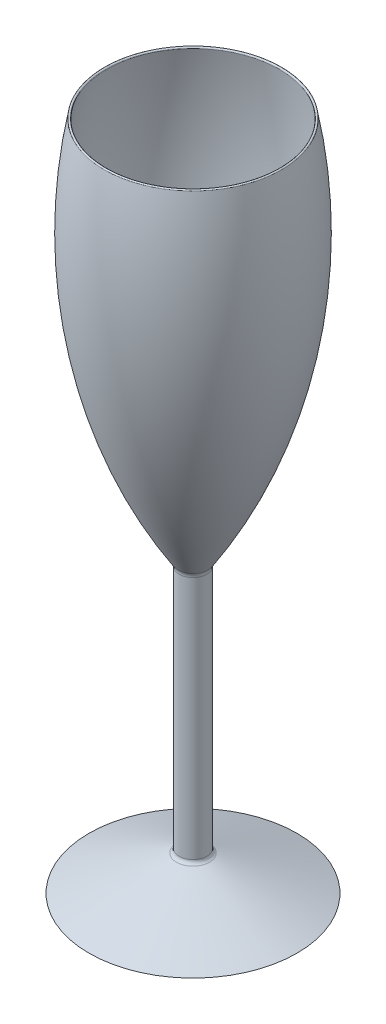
ISO-10303-21;
HEADER;
FILE_DESCRIPTION(('STEP AP214'),'2;1');
FILE_NAME('part.step','',(''),(''),'','','');
FILE_SCHEMA(('AUTOMOTIVE_DESIGN { 1 0 10303 214 1 1 1 1 }'));
ENDSEC;
DATA;
#1=APPLICATION_CONTEXT('core data for automotive mechanical design processes');
#2=APPLICATION_PROTOCOL_DEFINITION('international standard','automotive_design',2000,#1);
#3=PRODUCT_CONTEXT('',#1,'mechanical');
#4=PRODUCT('Part','Part','',(#3));
#5=PRODUCT_RELATED_PRODUCT_CATEGORY('part','',(#4));
#6=PRODUCT_DEFINITION_FORMATION('','',#4);
#7=PRODUCT_DEFINITION_CONTEXT('part definition',#1,'design');
#8=PRODUCT_DEFINITION('design','',#6,#7);
#9=PRODUCT_DEFINITION_SHAPE('','',#8);
#10=(LENGTH_UNIT() NAMED_UNIT(*) SI_UNIT(.MILLI.,.METRE.));
#11=(NAMED_UNIT(*) PLANE_ANGLE_UNIT() SI_UNIT($,.RADIAN.));
#12=(NAMED_UNIT(*) SI_UNIT($,.STERADIAN.) SOLID_ANGLE_UNIT());
#13=UNCERTAINTY_MEASURE_WITH_UNIT(LENGTH_MEASURE(1.E-05),#10,'distance_accuracy_value','');
#14=(GEOMETRIC_REPRESENTATION_CONTEXT(3) GLOBAL_UNCERTAINTY_ASSIGNED_CONTEXT((#13)) GLOBAL_UNIT_ASSIGNED_CONTEXT((#10,
#11,#12)) REPRESENTATION_CONTEXT('',''));
#15=CARTESIAN_POINT('',(0.,0.,0.));
#16=DIRECTION('',(0.,0.,1.));
#17=DIRECTION('',(1.,0.,0.));
#18=AXIS2_PLACEMENT_3D('',#15,#16,#17);
#19=CARTESIAN_POINT('',(0.,204.75125415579,-26.390677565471));
#20=CARTESIAN_POINT('',(-3.45351734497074,204.751254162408,-26.3906775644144));
#21=CARTESIAN_POINT('',(-6.9086410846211,204.751254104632,-25.7034107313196));
#22=CARTESIAN_POINT('',(-13.289909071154,204.751254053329,-23.0602029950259));
#23=CARTESIAN_POINT('',(-16.2190215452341,204.751254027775,-21.1030326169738));
#24=CARTESIAN_POINT('',(-21.1030326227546,204.751253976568,-16.2190215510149));
#25=CARTESIAN_POINT('',(-23.0602030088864,204.751253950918,-13.2899090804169));
#26=CARTESIAN_POINT('',(-25.7034107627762,204.751253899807,-6.90864109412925));
#27=CARTESIAN_POINT('',(-26.3906776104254,204.751253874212,-3.4535173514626));
#28=CARTESIAN_POINT('',(-26.3906776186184,204.751253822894,3.45351735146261));
#29=CARTESIAN_POINT('',(-25.7034107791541,204.751253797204,6.90864109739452));
#30=CARTESIAN_POINT('',(-23.0602030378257,204.751253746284,13.2899090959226));
#31=CARTESIAN_POINT('',(-21.1030326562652,204.751253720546,16.2190215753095));
#32=CARTESIAN_POINT('',(-16.219021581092,204.751253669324,21.1030326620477));
#33=CARTESIAN_POINT('',(-13.2899091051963,204.75125364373,23.0602030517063));
#34=CARTESIAN_POINT('',(-6.9086411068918,204.751253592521,25.7034108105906));
#35=CARTESIAN_POINT('',(-3.4535173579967,204.751253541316,26.3906776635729));
#36=CARTESIAN_POINT('',(3.4535173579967,204.751253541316,26.3906776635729));
#37=CARTESIAN_POINT('',(6.90864110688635,204.751253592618,25.7034108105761));
#38=CARTESIAN_POINT('',(13.2899091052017,204.751253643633,23.0602030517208));
#39=CARTESIAN_POINT('',(16.2190215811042,204.751253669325,21.1030326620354));
#40=CARTESIAN_POINT('',(21.1030326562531,204.751253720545,16.2190215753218));
#41=CARTESIAN_POINT('',(23.0602030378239,204.751253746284,13.2899090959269));
#42=CARTESIAN_POINT('',(25.7034107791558,204.751253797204,6.90864109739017));
#43=CARTESIAN_POINT('',(26.3906776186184,204.751253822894,3.45351735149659));
#44=CARTESIAN_POINT('',(26.3906776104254,204.751253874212,-3.45351735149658));
#45=CARTESIAN_POINT('',(25.703410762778,204.751253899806,-6.9086410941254));
#46=CARTESIAN_POINT('',(23.0602030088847,204.751253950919,-13.2899090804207));
#47=CARTESIAN_POINT('',(21.1030326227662,204.75125397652,-16.2190215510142));
#48=CARTESIAN_POINT('',(16.2190215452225,204.751254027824,-21.1030326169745));
#49=CARTESIAN_POINT('',(13.289909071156,204.751254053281,-23.0602029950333));
#50=CARTESIAN_POINT('',(6.90864108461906,204.75125410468,-25.7034107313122));
#51=CARTESIAN_POINT('',(3.45351734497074,204.751254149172,-26.3906775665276));
#52=CARTESIAN_POINT('',(0.,204.75125415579,-26.390677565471));
#53=CARTESIAN_POINT('',(3.22357900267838E-07,205.39899180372,-26.2872650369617));
#54=CARTESIAN_POINT('',(-3.43980943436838,205.398991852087,-26.2872649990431));
#55=CARTESIAN_POINT('',(-6.88173123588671,205.398992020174,-25.6026239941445));
#56=CARTESIAN_POINT('',(-13.2376701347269,205.39899223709,-22.9699076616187));
#57=CARTESIAN_POINT('',(-16.155590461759,205.398992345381,-21.0202154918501));
#58=CARTESIAN_POINT('',(-21.0202153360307,205.398992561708,-16.1555903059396));
#59=CARTESIAN_POINT('',(-22.9699072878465,205.398992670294,-13.2376698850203));
#60=CARTESIAN_POINT('',(-25.6026231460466,205.398992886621,-6.88173097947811));
#61=CARTESIAN_POINT('',(-26.2872638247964,205.398992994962,-3.43980925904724));
#62=CARTESIAN_POINT('',(-26.287263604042,205.39899321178,3.43980925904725));
#63=CARTESIAN_POINT('',(-25.6026227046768,205.398993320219,6.88173089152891));
#64=CARTESIAN_POINT('',(-22.9699065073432,205.39899353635,13.2376694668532));
#65=CARTESIAN_POINT('',(-21.0202144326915,205.398993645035,16.1555896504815));
#66=CARTESIAN_POINT('',(-16.1555894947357,205.398993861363,21.0202142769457));
#67=CARTESIAN_POINT('',(-13.2376692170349,205.398993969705,22.9699061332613));
#68=CARTESIAN_POINT('',(-6.88173063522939,205.398994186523,25.6026218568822));
#69=CARTESIAN_POINT('',(-3.43980908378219,205.398994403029,26.2872623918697));
#70=CARTESIAN_POINT('',(3.4398090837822,205.398994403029,26.2872623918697));
#71=CARTESIAN_POINT('',(6.88173063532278,205.398994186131,25.6026218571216));
#72=CARTESIAN_POINT('',(13.2376692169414,205.398993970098,22.9699061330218));
#73=CARTESIAN_POINT('',(16.1555894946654,205.398993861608,21.0202142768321));
#74=CARTESIAN_POINT('',(21.0202144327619,205.39899364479,16.1555896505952));
#75=CARTESIAN_POINT('',(22.9699065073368,205.39899353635,13.237669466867));
#76=CARTESIAN_POINT('',(25.6026227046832,205.398993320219,6.88173089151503));
#77=CARTESIAN_POINT('',(26.2872636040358,205.398993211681,3.43980925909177));
#78=CARTESIAN_POINT('',(26.2872638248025,205.39899299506,-3.43980925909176));
#79=CARTESIAN_POINT('',(25.6026231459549,205.39899288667,-6.8817309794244));
#80=CARTESIAN_POINT('',(22.9699072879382,205.398992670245,-13.237669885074));
#81=CARTESIAN_POINT('',(21.0202153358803,205.398992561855,-16.155590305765));
#82=CARTESIAN_POINT('',(16.1555904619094,205.398992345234,-21.0202154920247));
#83=CARTESIAN_POINT('',(13.2376701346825,205.39899223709,-22.9699076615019));
#84=CARTESIAN_POINT('',(6.88173123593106,205.398992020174,-25.6026239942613));
#85=CARTESIAN_POINT('',(3.43980943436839,205.398991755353,-26.2872650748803));
#86=CARTESIAN_POINT('',(3.22357900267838E-07,205.39899180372,-26.2872650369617));
#87=CARTESIAN_POINT('',(3.30385196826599E-07,205.511611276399,-26.933465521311));
#88=CARTESIAN_POINT('',(-3.5254669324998,205.511611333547,-26.9334655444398));
#89=CARTESIAN_POINT('',(-7.04988430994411,205.511611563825,-26.2324154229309));
#90=CARTESIAN_POINT('',(-13.5640978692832,205.511611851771,-23.5341399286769));
#91=CARTESIAN_POINT('',(-16.5519546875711,205.511611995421,-21.5377178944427));
#92=CARTESIAN_POINT('',(-21.5377179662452,205.511612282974,-16.5519547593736));
#93=CARTESIAN_POINT('',(-23.5341401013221,205.511612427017,-13.5640979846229));
#94=CARTESIAN_POINT('',(-26.2324158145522,205.511612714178,-7.04988442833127));
#95=CARTESIAN_POINT('',(-26.9334660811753,205.511612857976,-3.5254670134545));
#96=CARTESIAN_POINT('',(-26.9334661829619,205.51161314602,3.5254670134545));
#97=CARTESIAN_POINT('',(-26.2324160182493,205.511613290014,7.0498844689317));
#98=CARTESIAN_POINT('',(-23.5341404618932,205.511613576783,13.56409817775));
#99=CARTESIAN_POINT('',(-21.5377183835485,205.511613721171,16.5519550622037));
#100=CARTESIAN_POINT('',(-16.5519551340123,205.51161400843,21.5377184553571));
#101=CARTESIAN_POINT('',(-13.5640982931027,205.511614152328,23.5341406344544));
#102=CARTESIAN_POINT('',(-7.04988458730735,205.511614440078,26.2324164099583));
#103=CARTESIAN_POINT('',(-3.52546709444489,205.511614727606,26.9334667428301));
#104=CARTESIAN_POINT('',(3.5254670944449,205.511614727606,26.9334667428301));
#105=CARTESIAN_POINT('',(7.04988458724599,205.511614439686,26.2324164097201));
#106=CARTESIAN_POINT('',(13.564098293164,205.511614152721,23.5341406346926));
#107=CARTESIAN_POINT('',(16.5519551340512,205.511614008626,21.5377184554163));
#108=CARTESIAN_POINT('',(21.5377183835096,205.511613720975,16.5519550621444));
#109=CARTESIAN_POINT('',(23.5341404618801,205.511613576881,13.5640981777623));
#110=CARTESIAN_POINT('',(26.2324160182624,205.511613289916,7.04988446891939));
#111=CARTESIAN_POINT('',(26.9334661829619,205.511613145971,3.52546701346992));
#112=CARTESIAN_POINT('',(26.9334660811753,205.511612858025,-3.52546701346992));
#113=CARTESIAN_POINT('',(26.2324158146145,205.511612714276,-7.04988442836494));
#114=CARTESIAN_POINT('',(23.5341401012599,205.511612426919,-13.5640979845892));
#115=CARTESIAN_POINT('',(21.5377179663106,205.511612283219,-16.5519547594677));
#116=CARTESIAN_POINT('',(16.5519546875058,205.511611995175,-21.5377178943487));
#117=CARTESIAN_POINT('',(13.5640978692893,205.511611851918,-23.5341399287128));
#118=CARTESIAN_POINT('',(7.04988430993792,205.511611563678,-26.232415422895));
#119=CARTESIAN_POINT('',(3.52546693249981,205.511611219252,-26.9334654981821));
#120=CARTESIAN_POINT('',(3.30385196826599E-07,205.511611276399,-26.933465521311));
#121=CARTESIAN_POINT('',(0.,204.867078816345,-27.055269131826));
#122=CARTESIAN_POINT('',(-3.54161268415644,204.867078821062,-27.0552691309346));
#123=CARTESIAN_POINT('',(-7.08157978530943,204.867078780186,-26.3511259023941));
#124=CARTESIAN_POINT('',(-13.6256267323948,204.867078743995,-23.6404929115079));
#125=CARTESIAN_POINT('',(-16.6266659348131,204.867078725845,-21.6352626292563));
#126=CARTESIAN_POINT('',(-21.6352626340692,204.867078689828,-16.626665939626));
#127=CARTESIAN_POINT('',(-23.6404929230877,204.867078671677,-13.6256267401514));
#128=CARTESIAN_POINT('',(-26.3511259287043,204.867078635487,-7.08157979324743));
#129=CARTESIAN_POINT('',(-27.0552691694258,204.867078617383,-3.54161268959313));
#130=CARTESIAN_POINT('',(-27.0552691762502,204.867078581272,3.54161268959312));
#131=CARTESIAN_POINT('',(-26.3511259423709,204.867078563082,7.08157979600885));
#132=CARTESIAN_POINT('',(-23.6404929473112,204.867078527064,13.6256267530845));
#133=CARTESIAN_POINT('',(-21.6352626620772,204.867078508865,16.6266659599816));
#134=CARTESIAN_POINT('',(-16.6266659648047,204.867078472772,21.6352626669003));
#135=CARTESIAN_POINT('',(-13.625626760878,204.867078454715,23.6404929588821));
#136=CARTESIAN_POINT('',(-7.08157980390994,204.867078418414,26.3511259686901));
#137=CARTESIAN_POINT('',(-3.54161269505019,204.86707838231,27.0552692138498));
#138=CARTESIAN_POINT('',(3.54161269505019,204.86707838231,27.0552692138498));
#139=CARTESIAN_POINT('',(7.08157980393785,204.867078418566,26.3511259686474));
#140=CARTESIAN_POINT('',(13.6256267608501,204.867078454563,23.6404929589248));
#141=CARTESIAN_POINT('',(16.6266659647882,204.867078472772,21.6352626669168));
#142=CARTESIAN_POINT('',(21.6352626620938,204.867078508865,16.6266659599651));
#143=CARTESIAN_POINT('',(23.6404929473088,204.867078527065,13.6256267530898));
#144=CARTESIAN_POINT('',(26.3511259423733,204.867078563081,7.08157979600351));
#145=CARTESIAN_POINT('',(27.0552691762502,204.867078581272,3.54161268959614));
#146=CARTESIAN_POINT('',(27.0552691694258,204.867078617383,-3.54161268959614));
#147=CARTESIAN_POINT('',(26.3511259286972,204.867078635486,-7.08157979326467));
#148=CARTESIAN_POINT('',(23.6404929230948,204.867078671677,-13.6256267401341));
#149=CARTESIAN_POINT('',(21.6352626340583,204.867078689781,-16.6266659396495));
#150=CARTESIAN_POINT('',(16.6266659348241,204.867078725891,-21.6352626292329));
#151=CARTESIAN_POINT('',(13.6256267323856,204.867078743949,-23.6404929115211));
#152=CARTESIAN_POINT('',(7.08157978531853,204.867078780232,-26.3511259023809));
#153=CARTESIAN_POINT('',(3.54161268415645,204.867078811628,-27.0552691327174));
#154=CARTESIAN_POINT('',(0.,204.867078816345,-27.055269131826));
#155=(BOUNDED_SURFACE() B_SPLINE_SURFACE(3,3,((#19,#20,#21,#22,#23,#24,#25,#26,#27,#28,#29,#30,
#31,#32,#33,#34,#35,#36,#37,#38,#39,#40,#41,#42,#43,#44,#45,#46,#47,#48,#49,#50,#51,#52),(#53,
#54,#55,#56,#57,#58,#59,#60,#61,#62,#63,#64,#65,#66,#67,#68,#69,#70,#71,#72,#73,#74,#75,#76,#77,
#78,#79,#80,#81,#82,#83,#84,#85,#86),(#87,#88,#89,#90,#91,#92,#93,#94,#95,#96,#97,#98,#99,#100,
#101,#102,#103,#104,#105,#106,#107,#108,#109,#110,#111,#112,#113,#114,#115,#116,#117,#118,#119,
#120),(#121,#122,#123,#124,#125,#126,#127,#128,#129,#130,#131,#132,#133,#134,#135,#136,#137,
#138,#139,#140,#141,#142,#143,#144,#145,#146,#147,#148,#149,#150,#151,#152,#153,#154)),
.UNSPECIFIED.,.F.,.T.,.F.) B_SPLINE_SURFACE_WITH_KNOTS((4,4),(4,2,2,2,2,2,2,2,2,2,2,2,2,2,2,2,
4),(0.,1.),(0.5,0.5625,0.625,0.6875,0.75,0.8125,0.875,0.9375,1.,1.0625,1.125,1.1875,1.25,1.3125,
1.375,1.4375,1.5),.UNSPECIFIED.) GEOMETRIC_REPRESENTATION_ITEM() RATIONAL_B_SPLINE_SURFACE(((1.,
1.,1.,1.,1.,1.,1.,1.,1.,1.,1.,1.,1.,1.,1.,1.,1.,1.,1.,1.,1.,1.,1.,1.,1.,1.,1.,1.,1.,1.,1.,1.,1.,
1.),(0.342820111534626,0.342820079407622,0.342819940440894,0.342819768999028,0.342819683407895,
0.342819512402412,0.342819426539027,0.342819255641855,0.342819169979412,0.34281899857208,
0.342818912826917,0.342818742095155,0.342818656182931,0.342818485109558,0.342818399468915,
0.342818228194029,0.342818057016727,0.342818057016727,0.342818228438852,0.342818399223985,
0.342818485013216,0.342818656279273,0.342818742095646,0.342818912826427,0.342818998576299,
0.342819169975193,0.342819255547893,0.342819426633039,0.342819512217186,0.342819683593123,
0.34281976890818,0.342819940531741,0.342820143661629,0.342820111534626),(0.342820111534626,
0.342820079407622,0.342819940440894,0.342819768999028,0.342819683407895,0.342819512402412,
0.342819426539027,0.342819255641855,0.342819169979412,0.34281899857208,0.342818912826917,
0.342818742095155,0.342818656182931,0.342818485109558,0.342818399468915,0.342818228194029,
0.342818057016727,0.342818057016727,0.342818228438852,0.342818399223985,0.342818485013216,
0.342818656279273,0.342818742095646,0.342818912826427,0.342818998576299,0.342819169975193,
0.342819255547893,0.342819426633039,0.342819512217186,0.342819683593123,0.34281976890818,
0.342819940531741,0.342820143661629,0.342820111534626),(1.,1.,1.,1.,1.,1.,1.,1.,1.,1.,1.,1.,1.,
1.,1.,1.,1.,1.,1.,1.,1.,1.,1.,1.,1.,1.,1.,1.,1.,1.,1.,1.,1.,1.))) REPRESENTATION_ITEM('') SURFACE());
#156=CARTESIAN_POINT('',(0.,204.867078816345,-27.055269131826));
#157=CARTESIAN_POINT('',(-3.54161268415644,204.867078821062,-27.0552691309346));
#158=CARTESIAN_POINT('',(-7.08157978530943,204.867078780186,-26.3511259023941));
#159=CARTESIAN_POINT('',(-13.6256267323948,204.867078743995,-23.6404929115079));
#160=CARTESIAN_POINT('',(-16.6266659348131,204.867078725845,-21.6352626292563));
#161=CARTESIAN_POINT('',(-21.6352626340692,204.867078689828,-16.626665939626));
#162=CARTESIAN_POINT('',(-23.6404929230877,204.867078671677,-13.6256267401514));
#163=CARTESIAN_POINT('',(-26.3511259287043,204.867078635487,-7.08157979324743));
#164=CARTESIAN_POINT('',(-27.0552691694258,204.867078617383,-3.54161268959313));
#165=CARTESIAN_POINT('',(-27.0552691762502,204.867078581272,3.54161268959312));
#166=CARTESIAN_POINT('',(-26.3511259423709,204.867078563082,7.08157979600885));
#167=CARTESIAN_POINT('',(-23.6404929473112,204.867078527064,13.6256267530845));
#168=CARTESIAN_POINT('',(-21.6352626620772,204.867078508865,16.6266659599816));
#169=CARTESIAN_POINT('',(-16.6266659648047,204.867078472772,21.6352626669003));
#170=CARTESIAN_POINT('',(-13.625626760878,204.867078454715,23.6404929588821));
#171=CARTESIAN_POINT('',(-7.08157980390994,204.867078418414,26.3511259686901));
#172=CARTESIAN_POINT('',(-3.54161269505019,204.86707838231,27.0552692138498));
#173=CARTESIAN_POINT('',(3.54161269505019,204.86707838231,27.0552692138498));
#174=CARTESIAN_POINT('',(7.08157980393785,204.867078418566,26.3511259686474));
#175=CARTESIAN_POINT('',(13.6256267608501,204.867078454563,23.6404929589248));
#176=CARTESIAN_POINT('',(16.6266659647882,204.867078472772,21.6352626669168));
#177=CARTESIAN_POINT('',(21.6352626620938,204.867078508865,16.6266659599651));
#178=CARTESIAN_POINT('',(23.6404929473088,204.867078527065,13.6256267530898));
#179=CARTESIAN_POINT('',(26.3511259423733,204.867078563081,7.08157979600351));
#180=CARTESIAN_POINT('',(27.0552691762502,204.867078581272,3.54161268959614));
#181=CARTESIAN_POINT('',(27.0552691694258,204.867078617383,-3.54161268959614));
#182=CARTESIAN_POINT('',(26.3511259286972,204.867078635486,-7.08157979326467));
#183=CARTESIAN_POINT('',(23.6404929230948,204.867078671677,-13.6256267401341));
#184=CARTESIAN_POINT('',(21.6352626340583,204.867078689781,-16.6266659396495));
#185=CARTESIAN_POINT('',(16.6266659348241,204.867078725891,-21.6352626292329));
#186=CARTESIAN_POINT('',(13.6256267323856,204.867078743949,-23.6404929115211));
#187=CARTESIAN_POINT('',(7.08157978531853,204.867078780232,-26.3511259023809));
#188=CARTESIAN_POINT('',(3.54161268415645,204.867078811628,-27.0552691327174));
#189=CARTESIAN_POINT('',(0.,204.867078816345,-27.055269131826));
#190=(BOUNDED_CURVE() B_SPLINE_CURVE(3,(#156,#157,#158,#159,#160,#161,#162,#163,#164,#165,#166,
#167,#168,#169,#170,#171,#172,#173,#174,#175,#176,#177,#178,#179,#180,#181,#182,#183,#184,#185,
#186,#187,#188,#189),.UNSPECIFIED.,.T.,.F.) B_SPLINE_CURVE_WITH_KNOTS((4,2,2,2,2,2,2,2,2,2,2,2,
2,2,2,2,4),(0.5,0.5625,0.625,0.6875,0.75,0.8125,0.875,0.9375,1.,1.0625,1.125,1.1875,1.25,1.3125,
1.375,1.4375,1.5),
.UNSPECIFIED.) CURVE() GEOMETRIC_REPRESENTATION_ITEM() RATIONAL_B_SPLINE_CURVE((1.,1.,1.,1.,1.,
1.,1.,1.,1.,1.,1.,1.,1.,1.,1.,1.,1.,1.,1.,1.,1.,1.,1.,1.,1.,1.,1.,1.,1.,1.,1.,1.,1.,1.)) REPRESENTATION_ITEM(''));
#191=CARTESIAN_POINT('',(0.,204.867078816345,-27.055269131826));
#192=VERTEX_POINT('',#191);
#193=EDGE_CURVE('E79',#192,#192,#190,.F.);
#194=CARTESIAN_POINT('',(0.,204.75125415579,-26.390677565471));
#195=CARTESIAN_POINT('',(3.45351734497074,204.751254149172,-26.3906775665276));
#196=CARTESIAN_POINT('',(6.90864108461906,204.75125410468,-25.7034107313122));
#197=CARTESIAN_POINT('',(13.289909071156,204.751254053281,-23.0602029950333));
#198=CARTESIAN_POINT('',(16.2190215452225,204.751254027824,-21.1030326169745));
#199=CARTESIAN_POINT('',(21.1030326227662,204.75125397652,-16.2190215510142));
#200=CARTESIAN_POINT('',(23.0602030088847,204.751253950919,-13.2899090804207));
#201=CARTESIAN_POINT('',(25.703410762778,204.751253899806,-6.9086410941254));
#202=CARTESIAN_POINT('',(26.3906776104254,204.751253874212,-3.45351735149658));
#203=CARTESIAN_POINT('',(26.3906776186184,204.751253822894,3.45351735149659));
#204=CARTESIAN_POINT('',(25.7034107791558,204.751253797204,6.90864109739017));
#205=CARTESIAN_POINT('',(23.0602030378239,204.751253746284,13.2899090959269));
#206=CARTESIAN_POINT('',(21.1030326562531,204.751253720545,16.2190215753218));
#207=CARTESIAN_POINT('',(16.2190215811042,204.751253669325,21.1030326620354));
#208=CARTESIAN_POINT('',(13.2899091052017,204.751253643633,23.0602030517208));
#209=CARTESIAN_POINT('',(6.90864110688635,204.751253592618,25.7034108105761));
#210=CARTESIAN_POINT('',(3.4535173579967,204.751253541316,26.3906776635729));
#211=CARTESIAN_POINT('',(-3.4535173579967,204.751253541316,26.3906776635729));
#212=CARTESIAN_POINT('',(-6.9086411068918,204.751253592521,25.7034108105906));
#213=CARTESIAN_POINT('',(-13.2899091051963,204.75125364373,23.0602030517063));
#214=CARTESIAN_POINT('',(-16.219021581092,204.751253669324,21.1030326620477));
#215=CARTESIAN_POINT('',(-21.1030326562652,204.751253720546,16.2190215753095));
#216=CARTESIAN_POINT('',(-23.0602030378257,204.751253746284,13.2899090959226));
#217=CARTESIAN_POINT('',(-25.7034107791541,204.751253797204,6.90864109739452));
#218=CARTESIAN_POINT('',(-26.3906776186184,204.751253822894,3.45351735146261));
#219=CARTESIAN_POINT('',(-26.3906776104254,204.751253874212,-3.4535173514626));
#220=CARTESIAN_POINT('',(-25.7034107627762,204.751253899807,-6.90864109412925));
#221=CARTESIAN_POINT('',(-23.0602030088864,204.751253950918,-13.2899090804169));
#222=CARTESIAN_POINT('',(-21.1030326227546,204.751253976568,-16.2190215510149));
#223=CARTESIAN_POINT('',(-16.2190215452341,204.751254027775,-21.1030326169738));
#224=CARTESIAN_POINT('',(-13.289909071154,204.751254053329,-23.0602029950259));
#225=CARTESIAN_POINT('',(-6.9086410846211,204.751254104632,-25.7034107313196));
#226=CARTESIAN_POINT('',(-3.45351734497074,204.751254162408,-26.3906775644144));
#227=CARTESIAN_POINT('',(0.,204.75125415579,-26.390677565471));
#228=(BOUNDED_CURVE() B_SPLINE_CURVE(3,(#194,#195,#196,#197,#198,#199,#200,#201,#202,#203,#204,
#205,#206,#207,#208,#209,#210,#211,#212,#213,#214,#215,#216,#217,#218,#219,#220,#221,#222,#223,
#224,#225,#226,#227),.UNSPECIFIED.,.T.,.F.) B_SPLINE_CURVE_WITH_KNOTS((4,2,2,2,2,2,2,2,2,2,2,2,
2,2,2,2,4),(0.5,0.5625,0.625,0.6875,0.75,0.8125,0.875,0.9375,1.,1.0625,1.125,1.1875,1.25,1.3125,
1.375,1.4375,1.5),
.UNSPECIFIED.) CURVE() GEOMETRIC_REPRESENTATION_ITEM() RATIONAL_B_SPLINE_CURVE((1.,1.,1.,1.,1.,
1.,1.,1.,1.,1.,1.,1.,1.,1.,1.,1.,1.,1.,1.,1.,1.,1.,1.,1.,1.,1.,1.,1.,1.,1.,1.,1.,1.,1.)) REPRESENTATION_ITEM(''));
#229=CARTESIAN_POINT('',(0.,204.75125415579,-26.390677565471));
#230=VERTEX_POINT('',#229);
#231=EDGE_CURVE('E54',#230,#230,#228,.F.);
#232=ORIENTED_EDGE('',*,*,#193,.F.);
#233=EDGE_LOOP('',(#232));
#234=FACE_BOUND('',#233,.T.);
#235=ORIENTED_EDGE('',*,*,#231,.F.);
#236=EDGE_LOOP('',(#235));
#237=FACE_BOUND('',#236,.T.);
#238=ADVANCED_FACE('F32',(#234,#237),#155,.T.);
#239=CARTESIAN_POINT('',(0.,0.,0.));
#240=DIRECTION('',(0.,-1.,0.));
#241=DIRECTION('',(0.,0.,-1.));
#242=AXIS2_PLACEMENT_3D('',#239,#240,#241);
#243=PLANE('',#242);
#244=CARTESIAN_POINT('',(0.,0.,0.));
#245=DIRECTION('',(0.,1.,0.));
#246=DIRECTION('',(0.,0.,1.));
#247=AXIS2_PLACEMENT_3D('',#244,#245,#246);
#248=CIRCLE('',#247,31.75);
#249=CARTESIAN_POINT('',(0.,0.,-31.75));
#250=VERTEX_POINT('',#249);
#251=EDGE_CURVE('E123',#250,#250,#248,.T.);
#252=ORIENTED_EDGE('',*,*,#251,.F.);
#253=EDGE_LOOP('',(#252));
#254=FACE_BOUND('',#253,.T.);
#255=ADVANCED_FACE('F139',(#254),#243,.T.);
#256=CARTESIAN_POINT('',(0.,11.0170487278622,0.));
#257=DIRECTION('',(0.,-1.,0.));
#258=DIRECTION('',(0.,0.,-1.));
#259=AXIS2_PLACEMENT_3D('',#256,#257,#258);
#260=CONICAL_SURFACE('',#259,4.22800595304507,1.19003152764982);
#261=CARTESIAN_POINT('',(0.,10.6975978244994,0.));
#262=DIRECTION('',(0.,-1.,0.));
#263=DIRECTION('',(0.,0.,-1.));
#264=AXIS2_PLACEMENT_3D('',#261,#262,#263);
#265=CIRCLE('',#264,5.02603508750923);
#266=CARTESIAN_POINT('',(0.,10.6975978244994,-5.02603508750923));
#267=VERTEX_POINT('',#266);
#268=EDGE_CURVE('E10',#267,#267,#265,.T.);
#269=CARTESIAN_POINT('',(0.,10.6975978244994,-5.02603508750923));
#270=CARTESIAN_POINT('',(0.,10.5861645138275,-5.30440972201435));
#271=CARTESIAN_POINT('',(0.,10.4747312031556,-5.58278435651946));
#272=CARTESIAN_POINT('',(0.,10.2518645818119,-6.13953362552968));
#273=CARTESIAN_POINT('',(0.,10.14043127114,-6.4179082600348));
#274=CARTESIAN_POINT('',(0.,9.91756464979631,-6.97465752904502));
#275=CARTESIAN_POINT('',(0.,9.80613133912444,-7.25303216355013));
#276=CARTESIAN_POINT('',(0.,9.5832647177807,-7.80978143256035));
#277=CARTESIAN_POINT('',(0.,9.47183140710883,-8.08815606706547));
#278=CARTESIAN_POINT('',(0.,9.24896478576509,-8.64490533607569));
#279=CARTESIAN_POINT('',(0.,9.13753147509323,-8.9232799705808));
#280=CARTESIAN_POINT('',(0.,8.91466485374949,-9.48002923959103));
#281=CARTESIAN_POINT('',(0.,8.80323154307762,-9.75840387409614));
#282=CARTESIAN_POINT('',(0.,8.58036492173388,-10.3151531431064));
#283=CARTESIAN_POINT('',(0.,8.46893161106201,-10.5935277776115));
#284=CARTESIAN_POINT('',(0.,8.24606498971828,-11.1502770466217));
#285=CARTESIAN_POINT('',(0.,8.13463167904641,-11.4286516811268));
#286=CARTESIAN_POINT('',(0.,7.91176505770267,-11.985400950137));
#287=CARTESIAN_POINT('',(0.,7.8003317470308,-12.2637755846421));
#288=CARTESIAN_POINT('',(0.,7.57746512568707,-12.8205248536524));
#289=CARTESIAN_POINT('',(0.,7.4660318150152,-13.0988994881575));
#290=CARTESIAN_POINT('',(0.,7.24316519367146,-13.6556487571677));
#291=CARTESIAN_POINT('',(0.,7.13173188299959,-13.9340233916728));
#292=CARTESIAN_POINT('',(0.,6.90886526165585,-14.490772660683));
#293=CARTESIAN_POINT('',(0.,6.79743195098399,-14.7691472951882));
#294=CARTESIAN_POINT('',(0.,6.57456532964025,-15.3258965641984));
#295=CARTESIAN_POINT('',(0.,6.46313201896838,-15.6042711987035));
#296=CARTESIAN_POINT('',(0.,6.24026539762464,-16.1610204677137));
#297=CARTESIAN_POINT('',(0.,6.12883208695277,-16.4393951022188));
#298=CARTESIAN_POINT('',(0.,5.90596546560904,-16.9961443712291));
#299=CARTESIAN_POINT('',(0.,5.79453215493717,-17.2745190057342));
#300=CARTESIAN_POINT('',(0.,5.57166553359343,-17.8312682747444));
#301=CARTESIAN_POINT('',(0.,5.46023222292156,-18.1096429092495));
#302=CARTESIAN_POINT('',(0.,5.23736560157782,-18.6663921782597));
#303=CARTESIAN_POINT('',(0.,5.12593229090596,-18.9447668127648));
#304=CARTESIAN_POINT('',(0.,4.90306566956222,-19.5015160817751));
#305=CARTESIAN_POINT('',(0.,4.79163235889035,-19.7798907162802));
#306=CARTESIAN_POINT('',(0.,4.56876573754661,-20.3366399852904));
#307=CARTESIAN_POINT('',(0.,4.45733242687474,-20.6150146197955));
#308=CARTESIAN_POINT('',(0.,4.23446580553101,-21.1717638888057));
#309=CARTESIAN_POINT('',(0.,4.12303249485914,-21.4501385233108));
#310=CARTESIAN_POINT('',(0.,3.9001658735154,-22.0068877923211));
#311=CARTESIAN_POINT('',(0.,3.78873256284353,-22.2852624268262));
#312=CARTESIAN_POINT('',(0.,3.5658659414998,-22.8420116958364));
#313=CARTESIAN_POINT('',(0.,3.45443263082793,-23.1203863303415));
#314=CARTESIAN_POINT('',(0.,3.23156600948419,-23.6771355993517));
#315=CARTESIAN_POINT('',(0.,3.12013269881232,-23.9555102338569));
#316=CARTESIAN_POINT('',(0.,2.89726607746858,-24.5122595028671));
#317=CARTESIAN_POINT('',(0.,2.78583276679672,-24.7906341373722));
#318=CARTESIAN_POINT('',(0.,2.56296614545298,-25.3473834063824));
#319=CARTESIAN_POINT('',(0.,2.45153283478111,-25.6257580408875));
#320=CARTESIAN_POINT('',(0.,2.22866621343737,-26.1825073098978));
#321=CARTESIAN_POINT('',(0.,2.11723290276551,-26.4608819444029));
#322=CARTESIAN_POINT('',(0.,1.89436628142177,-27.0176312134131));
#323=CARTESIAN_POINT('',(0.,1.7829329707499,-27.2960058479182));
#324=CARTESIAN_POINT('',(0.,1.56006634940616,-27.8527551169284));
#325=CARTESIAN_POINT('',(0.,1.44863303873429,-28.1311297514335));
#326=CARTESIAN_POINT('',(0.,1.22576641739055,-28.6878790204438));
#327=CARTESIAN_POINT('',(0.,1.11433310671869,-28.9662536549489));
#328=CARTESIAN_POINT('',(0.,0.891466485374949,-29.5230029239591));
#329=CARTESIAN_POINT('',(0.,0.780033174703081,-29.8013775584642));
#330=CARTESIAN_POINT('',(0.,0.557166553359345,-30.3581268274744));
#331=CARTESIAN_POINT('',(0.,0.445733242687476,-30.6365014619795));
#332=CARTESIAN_POINT('',(0.,0.222866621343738,-31.1932507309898));
#333=CARTESIAN_POINT('',(0.,0.111433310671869,-31.4716253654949));
#334=CARTESIAN_POINT('',(0.,0.,-31.75));
#335=B_SPLINE_CURVE_WITH_KNOTS('',3,(#269,#270,#271,#272,#273,#274,#275,#276,#277,#278,#279,
#280,#281,#282,#283,#284,#285,#286,#287,#288,#289,#290,#291,#292,#293,#294,#295,#296,#297,#298,
#299,#300,#301,#302,#303,#304,#305,#306,#307,#308,#309,#310,#311,#312,#313,#314,#315,#316,#317,
#318,#319,#320,#321,#322,#323,#324,#325,#326,#327,#328,#329,#330,#331,#332,#333,#334),
.UNSPECIFIED.,.F.,.F.,(4,2,2,2,2,2,2,2,2,2,2,2,2,2,2,2,2,2,2,2,2,2,2,2,2,2,2,2,2,2,2,2,4),(0.,
0.899548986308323,1.79909797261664,2.69864695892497,3.59819594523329,4.49774493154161,
5.39729391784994,6.29684290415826,7.19639189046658,8.09594087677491,8.99548986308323,
9.89503884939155,10.7945878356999,11.6941368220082,12.5936858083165,13.4932347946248,
14.3927837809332,15.2923327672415,16.1918817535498,17.0914307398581,17.9909797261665,
18.8905287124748,19.7900776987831,20.6896266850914,21.5891756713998,22.4887246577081,
23.3882736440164,24.2878226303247,25.1873716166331,26.0869206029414,26.9864695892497,
27.886018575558,28.7855675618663),.UNSPECIFIED.);
#336=EDGE_CURVE('BSEAM137',#267,#250,#335,.T.);
#337=ORIENTED_EDGE('',*,*,#268,.T.);
#338=ORIENTED_EDGE('',*,*,#251,.T.);
#339=ORIENTED_EDGE('',*,*,#336,.T.);
#340=ORIENTED_EDGE('',*,*,#336,.F.);
#341=EDGE_LOOP('',(#337,#339,#338,#340));
#342=FACE_BOUND('',#341,.T.);
#343=ADVANCED_FACE('F137',(#342),#260,.T.);
#344=CARTESIAN_POINT('',(0.,197.571317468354,0.));
#345=DIRECTION('',(0.,1.,0.));
#346=DIRECTION('',(0.,0.,1.));
#347=AXIS2_PLACEMENT_3D('',#344,#345,#346);
#348=CYLINDRICAL_SURFACE('',#347,4.22800595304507);
#349=CARTESIAN_POINT('',(0.,11.876641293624,0.));
#350=DIRECTION('',(0.,1.,0.));
#351=DIRECTION('',(0.,0.,1.));
#352=AXIS2_PLACEMENT_3D('',#349,#350,#351);
#353=CIRCLE('',#352,4.22800595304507);
#354=CARTESIAN_POINT('',(0.,11.876641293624,4.22800595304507));
#355=VERTEX_POINT('',#354);
#356=EDGE_CURVE('E41',#355,#355,#353,.T.);
#357=ORIENTED_EDGE('',*,*,#356,.T.);
#358=EDGE_LOOP('',(#357));
#359=FACE_BOUND('',#358,.T.);
#360=CARTESIAN_POINT('',(0.,86.4759339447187,0.));
#361=DIRECTION('',(0.,1.,0.));
#362=DIRECTION('',(0.,0.,1.));
#363=AXIS2_PLACEMENT_3D('',#360,#361,#362);
#364=CIRCLE('',#363,4.22800595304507);
#365=CARTESIAN_POINT('',(0.,86.4759339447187,4.22800595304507));
#366=VERTEX_POINT('',#365);
#367=EDGE_CURVE('E45',#366,#366,#364,.F.);
#368=ORIENTED_EDGE('',*,*,#367,.T.);
#369=EDGE_LOOP('',(#368));
#370=FACE_BOUND('',#369,.T.);
#371=ADVANCED_FACE('F110',(#359,#370),#348,.T.);
#372=CARTESIAN_POINT('',(0.,174.749468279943,0.));
#373=DIRECTION('',(0.,1.,0.));
#374=DIRECTION('',(0.,0.,1.));
#375=AXIS2_PLACEMENT_3D('',#372,#373,#374);
#376=DEGENERATE_TOROIDAL_SURFACE('',#375,132.314207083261,162.190321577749,.F.);
#377=CARTESIAN_POINT('',(0.,87.8370359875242,0.));
#378=DIRECTION('',(0.,1.,0.));
#379=DIRECTION('',(0.,0.,1.));
#380=AXIS2_PLACEMENT_3D('',#377,#378,#379);
#381=CIRCLE('',#380,4.62347774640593);
#382=CARTESIAN_POINT('',(0.,87.8370359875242,4.62347774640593));
#383=VERTEX_POINT('',#382);
#384=EDGE_CURVE('E49',#383,#383,#381,.T.);
#385=ORIENTED_EDGE('',*,*,#384,.T.);
#386=EDGE_LOOP('',(#385));
#387=FACE_BOUND('',#386,.T.);
#388=ORIENTED_EDGE('',*,*,#193,.T.);
#389=EDGE_LOOP('',(#388));
#390=FACE_BOUND('',#389,.T.);
#391=ADVANCED_FACE('F105',(#387,#390),#376,.F.);
#392=CARTESIAN_POINT('',(-0.772460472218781,91.1999476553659,0.));
#393=DIRECTION('',(0.,1.,0.));
#394=DIRECTION('',(0.,0.,1.));
#395=AXIS2_PLACEMENT_3D('',#392,#393,#394);
#396=PLANE('',#395);
#397=CARTESIAN_POINT('',(0.,91.1999476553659,0.));
#398=DIRECTION('',(0.,-1.,0.));
#399=DIRECTION('',(0.,0.,-1.));
#400=AXIS2_PLACEMENT_3D('',#397,#398,#399);
#401=CIRCLE('',#400,0.772460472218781);
#402=CARTESIAN_POINT('',(0.,91.1999476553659,-0.772460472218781));
#403=VERTEX_POINT('',#402);
#404=EDGE_CURVE('E126',#403,#403,#401,.T.);
#405=ORIENTED_EDGE('',*,*,#404,.F.);
#406=EDGE_LOOP('',(#405));
#407=FACE_BOUND('',#406,.T.);
#408=ADVANCED_FACE('F101',(#407),#396,.T.);
#409=CARTESIAN_POINT('',(0.,93.7399476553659,0.));
#410=DIRECTION('',(0.,-1.,0.));
#411=DIRECTION('',(0.,0.,-1.));
#412=AXIS2_PLACEMENT_3D('',#409,#410,#411);
#413=DEGENERATE_TOROIDAL_SURFACE('',#412,0.772460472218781,2.54,.T.);
#414=ORIENTED_EDGE('',*,*,#404,.T.);
#415=EDGE_LOOP('',(#414));
#416=FACE_BOUND('',#415,.T.);
#417=CARTESIAN_POINT('',(0.,92.3687453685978,0.));
#418=DIRECTION('',(0.,-1.,0.));
#419=DIRECTION('',(0.,0.,-1.));
#420=AXIS2_PLACEMENT_3D('',#417,#418,#419);
#421=CIRCLE('',#420,2.91054472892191);
#422=CARTESIAN_POINT('',(0.,92.3687453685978,-2.91054472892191));
#423=VERTEX_POINT('',#422);
#424=EDGE_CURVE('E129',#423,#423,#421,.T.);
#425=ORIENTED_EDGE('',*,*,#424,.F.);
#426=EDGE_LOOP('',(#425));
#427=FACE_BOUND('',#426,.T.);
#428=ADVANCED_FACE('F96',(#416,#427),#413,.F.);
#429=CARTESIAN_POINT('',(0.,179.349489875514,0.));
#430=DIRECTION('',(0.,-1.,0.));
#431=DIRECTION('',(0.,0.,-1.));
#432=AXIS2_PLACEMENT_3D('',#429,#430,#431);
#433=DEGENERATE_TOROIDAL_SURFACE('',#432,132.71653397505,161.122172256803,.F.);
#434=ORIENTED_EDGE('',*,*,#231,.T.);
#435=EDGE_LOOP('',(#434));
#436=FACE_BOUND('',#435,.T.);
#437=ORIENTED_EDGE('',*,*,#424,.T.);
#438=EDGE_LOOP('',(#437));
#439=FACE_BOUND('',#438,.T.);
#440=ADVANCED_FACE('F85',(#436,#439),#433,.T.);
#441=CARTESIAN_POINT('',(0.,86.4759339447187,0.));
#442=DIRECTION('',(0.,1.,0.));
#443=DIRECTION('',(0.,0.,1.));
#444=AXIS2_PLACEMENT_3D('',#441,#442,#443);
#445=TOROIDAL_SURFACE('',#444,6.76800595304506,2.54);
#446=ORIENTED_EDGE('',*,*,#367,.F.);
#447=EDGE_LOOP('',(#446));
#448=FACE_BOUND('',#447,.T.);
#449=ORIENTED_EDGE('',*,*,#384,.F.);
#450=EDGE_LOOP('',(#449));
#451=FACE_BOUND('',#450,.T.);
#452=ADVANCED_FACE('F95',(#448,#451),#445,.F.);
#453=CARTESIAN_POINT('',(0.,11.876641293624,0.));
#454=DIRECTION('',(0.,1.,0.));
#455=DIRECTION('',(0.,0.,1.));
#456=AXIS2_PLACEMENT_3D('',#453,#454,#455);
#457=TOROIDAL_SURFACE('',#456,5.49800595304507,1.27);
#458=ORIENTED_EDGE('',*,*,#268,.F.);
#459=EDGE_LOOP('',(#458));
#460=FACE_BOUND('',#459,.T.);
#461=ORIENTED_EDGE('',*,*,#356,.F.);
#462=EDGE_LOOP('',(#461));
#463=FACE_BOUND('',#462,.T.);
#464=ADVANCED_FACE('F189',(#460,#463),#457,.F.);
#465=CLOSED_SHELL('',(#238,#255,#343,#371,#391,#408,#428,#440,#452,#464));
#466=MANIFOLD_SOLID_BREP('B2',#465);
#467=ADVANCED_BREP_SHAPE_REPRESENTATION('',(#18,#466),#14);
#468=SHAPE_DEFINITION_REPRESENTATION(#9,#467);
ENDSEC;
END-ISO-10303-21;
